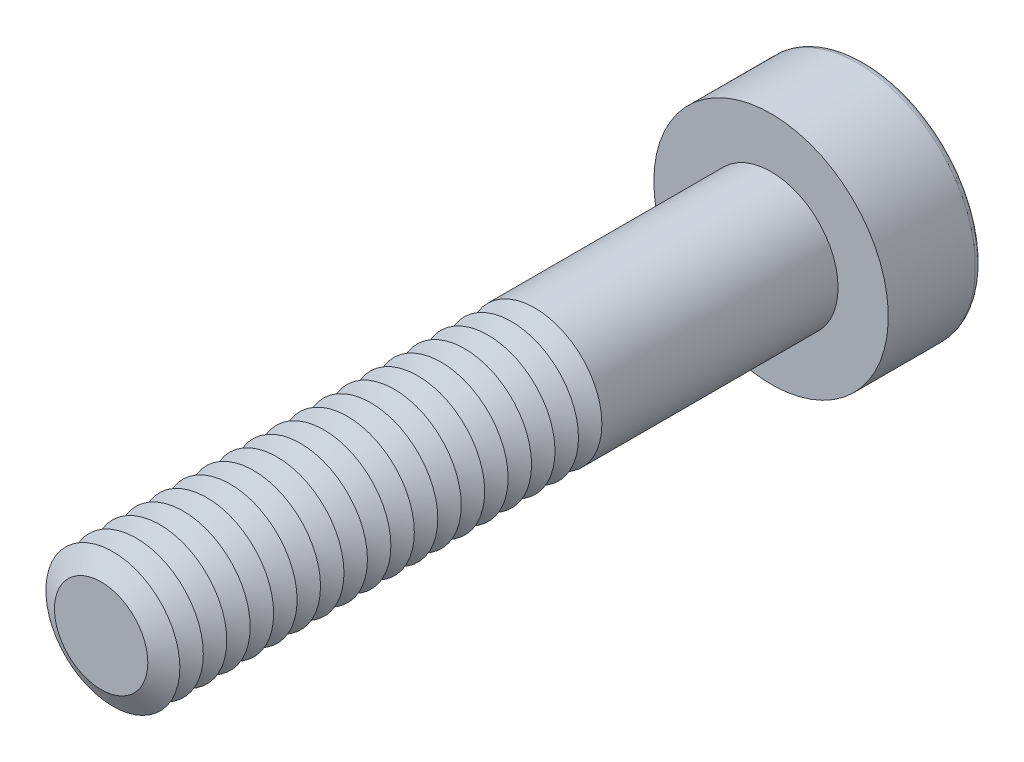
ISO-10303-21;
HEADER;
FILE_DESCRIPTION(('STEP AP214'),'2;1');
FILE_NAME('part.step','',(''),(''),'','','');
FILE_SCHEMA(('AUTOMOTIVE_DESIGN { 1 0 10303 214 1 1 1 1 }'));
ENDSEC;
DATA;
#1=APPLICATION_CONTEXT('core data for automotive mechanical design processes');
#2=APPLICATION_PROTOCOL_DEFINITION('international standard','automotive_design',2000,#1);
#3=PRODUCT_CONTEXT('',#1,'mechanical');
#4=PRODUCT('Part','Part','',(#3));
#5=PRODUCT_RELATED_PRODUCT_CATEGORY('part','',(#4));
#6=PRODUCT_DEFINITION_FORMATION('','',#4);
#7=PRODUCT_DEFINITION_CONTEXT('part definition',#1,'design');
#8=PRODUCT_DEFINITION('design','',#6,#7);
#9=PRODUCT_DEFINITION_SHAPE('','',#8);
#10=(LENGTH_UNIT() NAMED_UNIT(*) SI_UNIT(.MILLI.,.METRE.));
#11=(NAMED_UNIT(*) PLANE_ANGLE_UNIT() SI_UNIT($,.RADIAN.));
#12=(NAMED_UNIT(*) SI_UNIT($,.STERADIAN.) SOLID_ANGLE_UNIT());
#13=UNCERTAINTY_MEASURE_WITH_UNIT(LENGTH_MEASURE(1.E-05),#10,'distance_accuracy_value','');
#14=(GEOMETRIC_REPRESENTATION_CONTEXT(3) GLOBAL_UNCERTAINTY_ASSIGNED_CONTEXT((#13)) GLOBAL_UNIT_ASSIGNED_CONTEXT((#10,
#11,#12)) REPRESENTATION_CONTEXT('',''));
#15=CARTESIAN_POINT('',(0.,0.,0.));
#16=DIRECTION('',(0.,0.,1.));
#17=DIRECTION('',(1.,0.,0.));
#18=AXIS2_PLACEMENT_3D('',#15,#16,#17);
#19=CARTESIAN_POINT('',(0.,0.,17.55));
#20=DIRECTION('',(0.,0.,1.));
#21=DIRECTION('',(1.,0.,0.));
#22=AXIS2_PLACEMENT_3D('',#19,#20,#21);
#23=CONICAL_SURFACE('',#22,2.,1.0471975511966);
#24=CARTESIAN_POINT('',(0.,0.,17.2));
#25=DIRECTION('',(0.,0.,1.));
#26=DIRECTION('',(1.,0.,0.));
#27=AXIS2_PLACEMENT_3D('',#24,#25,#26);
#28=CIRCLE('',#27,1.39378221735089);
#29=CARTESIAN_POINT('',(1.39378221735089,0.,17.2));
#30=VERTEX_POINT('',#29);
#31=EDGE_CURVE('E312',#30,#30,#28,.T.);
#32=ORIENTED_EDGE('',*,*,#31,.T.);
#33=EDGE_LOOP('',(#32));
#34=FACE_BOUND('',#33,.T.);
#35=CARTESIAN_POINT('',(0.,0.,17.55));
#36=DIRECTION('',(0.,0.,1.));
#37=DIRECTION('',(1.,0.,0.));
#38=AXIS2_PLACEMENT_3D('',#35,#36,#37);
#39=CIRCLE('',#38,2.);
#40=CARTESIAN_POINT('',(2.,0.,17.55));
#41=VERTEX_POINT('',#40);
#42=EDGE_CURVE('E315',#41,#41,#39,.T.);
#43=ORIENTED_EDGE('',*,*,#42,.F.);
#44=EDGE_LOOP('',(#43));
#45=FACE_BOUND('',#44,.T.);
#46=ADVANCED_FACE('F39',(#34,#45),#23,.T.);
#47=CARTESIAN_POINT('',(0.,0.,17.2));
#48=DIRECTION('',(0.,0.,-1.));
#49=DIRECTION('',(-1.,0.,0.));
#50=AXIS2_PLACEMENT_3D('',#47,#48,#49);
#51=CONICAL_SURFACE('',#50,1.39378221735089,1.0471975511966);
#52=CARTESIAN_POINT('',(0.,0.,16.85));
#53=DIRECTION('',(0.,0.,1.));
#54=DIRECTION('',(1.,0.,0.));
#55=AXIS2_PLACEMENT_3D('',#52,#53,#54);
#56=CIRCLE('',#55,2.);
#57=CARTESIAN_POINT('',(2.,0.,16.85));
#58=VERTEX_POINT('',#57);
#59=EDGE_CURVE('E323',#58,#58,#56,.T.);
#60=ORIENTED_EDGE('',*,*,#59,.T.);
#61=EDGE_LOOP('',(#60));
#62=FACE_BOUND('',#61,.T.);
#63=ORIENTED_EDGE('',*,*,#31,.F.);
#64=EDGE_LOOP('',(#63));
#65=FACE_BOUND('',#64,.T.);
#66=ADVANCED_FACE('F245',(#62,#65),#51,.T.);
#67=CARTESIAN_POINT('',(0.,0.,20.));
#68=DIRECTION('',(0.,0.,1.));
#69=DIRECTION('',(1.,0.,0.));
#70=AXIS2_PLACEMENT_3D('',#67,#68,#69);
#71=PLANE('',#70);
#72=CARTESIAN_POINT('',(0.,0.,20.));
#73=DIRECTION('',(0.,0.,1.));
#74=DIRECTION('',(1.,0.,0.));
#75=AXIS2_PLACEMENT_3D('',#72,#73,#74);
#76=CIRCLE('',#75,1.39378221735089);
#77=CARTESIAN_POINT('',(1.39378221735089,0.,20.));
#78=VERTEX_POINT('',#77);
#79=EDGE_CURVE('E174',#78,#78,#76,.T.);
#80=ORIENTED_EDGE('',*,*,#79,.T.);
#81=EDGE_LOOP('',(#80));
#82=FACE_BOUND('',#81,.T.);
#83=ADVANCED_FACE('F251',(#82),#71,.T.);
#84=CARTESIAN_POINT('',(0.,0.,20.));
#85=DIRECTION('',(0.,0.,-1.));
#86=DIRECTION('',(-1.,0.,0.));
#87=AXIS2_PLACEMENT_3D('',#84,#85,#86);
#88=CONICAL_SURFACE('',#87,1.39378221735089,1.0471975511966);
#89=CARTESIAN_POINT('',(0.,0.,19.65));
#90=DIRECTION('',(0.,0.,1.));
#91=DIRECTION('',(1.,0.,0.));
#92=AXIS2_PLACEMENT_3D('',#89,#90,#91);
#93=CIRCLE('',#92,2.);
#94=CARTESIAN_POINT('',(2.,0.,19.65));
#95=VERTEX_POINT('',#94);
#96=EDGE_CURVE('E291',#95,#95,#93,.T.);
#97=ORIENTED_EDGE('',*,*,#96,.T.);
#98=EDGE_LOOP('',(#97));
#99=FACE_BOUND('',#98,.T.);
#100=ORIENTED_EDGE('',*,*,#79,.F.);
#101=EDGE_LOOP('',(#100));
#102=FACE_BOUND('',#101,.T.);
#103=ADVANCED_FACE('F199',(#99,#102),#88,.T.);
#104=CARTESIAN_POINT('',(0.,0.,19.65));
#105=DIRECTION('',(0.,0.,1.));
#106=DIRECTION('',(1.,0.,0.));
#107=AXIS2_PLACEMENT_3D('',#104,#105,#106);
#108=CONICAL_SURFACE('',#107,2.,1.0471975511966);
#109=CARTESIAN_POINT('',(0.,0.,19.3));
#110=DIRECTION('',(0.,0.,1.));
#111=DIRECTION('',(1.,0.,0.));
#112=AXIS2_PLACEMENT_3D('',#109,#110,#111);
#113=CIRCLE('',#112,1.39378221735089);
#114=CARTESIAN_POINT('',(1.39378221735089,0.,19.3));
#115=VERTEX_POINT('',#114);
#116=EDGE_CURVE('E288',#115,#115,#113,.T.);
#117=ORIENTED_EDGE('',*,*,#116,.T.);
#118=EDGE_LOOP('',(#117));
#119=FACE_BOUND('',#118,.T.);
#120=ORIENTED_EDGE('',*,*,#96,.F.);
#121=EDGE_LOOP('',(#120));
#122=FACE_BOUND('',#121,.T.);
#123=ADVANCED_FACE('F277',(#119,#122),#108,.T.);
#124=CARTESIAN_POINT('',(0.,0.,19.3));
#125=DIRECTION('',(0.,0.,-1.));
#126=DIRECTION('',(-1.,0.,0.));
#127=AXIS2_PLACEMENT_3D('',#124,#125,#126);
#128=CONICAL_SURFACE('',#127,1.39378221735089,1.0471975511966);
#129=CARTESIAN_POINT('',(0.,0.,18.95));
#130=DIRECTION('',(0.,0.,1.));
#131=DIRECTION('',(1.,0.,0.));
#132=AXIS2_PLACEMENT_3D('',#129,#130,#131);
#133=CIRCLE('',#132,2.);
#134=CARTESIAN_POINT('',(2.,0.,18.95));
#135=VERTEX_POINT('',#134);
#136=EDGE_CURVE('E299',#135,#135,#133,.T.);
#137=ORIENTED_EDGE('',*,*,#136,.T.);
#138=EDGE_LOOP('',(#137));
#139=FACE_BOUND('',#138,.T.);
#140=ORIENTED_EDGE('',*,*,#116,.F.);
#141=EDGE_LOOP('',(#140));
#142=FACE_BOUND('',#141,.T.);
#143=ADVANCED_FACE('F274',(#139,#142),#128,.T.);
#144=CARTESIAN_POINT('',(0.,0.,18.95));
#145=DIRECTION('',(0.,0.,1.));
#146=DIRECTION('',(1.,0.,0.));
#147=AXIS2_PLACEMENT_3D('',#144,#145,#146);
#148=CONICAL_SURFACE('',#147,2.,1.0471975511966);
#149=CARTESIAN_POINT('',(0.,0.,18.6));
#150=DIRECTION('',(0.,0.,1.));
#151=DIRECTION('',(1.,0.,0.));
#152=AXIS2_PLACEMENT_3D('',#149,#150,#151);
#153=CIRCLE('',#152,1.39378221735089);
#154=CARTESIAN_POINT('',(1.39378221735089,0.,18.6));
#155=VERTEX_POINT('',#154);
#156=EDGE_CURVE('E293',#155,#155,#153,.T.);
#157=ORIENTED_EDGE('',*,*,#156,.T.);
#158=EDGE_LOOP('',(#157));
#159=FACE_BOUND('',#158,.T.);
#160=ORIENTED_EDGE('',*,*,#136,.F.);
#161=EDGE_LOOP('',(#160));
#162=FACE_BOUND('',#161,.T.);
#163=ADVANCED_FACE('F270',(#159,#162),#148,.T.);
#164=CARTESIAN_POINT('',(0.,0.,18.6));
#165=DIRECTION('',(0.,0.,-1.));
#166=DIRECTION('',(-1.,0.,0.));
#167=AXIS2_PLACEMENT_3D('',#164,#165,#166);
#168=CONICAL_SURFACE('',#167,1.39378221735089,1.0471975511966);
#169=CARTESIAN_POINT('',(0.,0.,18.25));
#170=DIRECTION('',(0.,0.,1.));
#171=DIRECTION('',(1.,0.,0.));
#172=AXIS2_PLACEMENT_3D('',#169,#170,#171);
#173=CIRCLE('',#172,2.);
#174=CARTESIAN_POINT('',(2.,0.,18.25));
#175=VERTEX_POINT('',#174);
#176=EDGE_CURVE('E309',#175,#175,#173,.T.);
#177=ORIENTED_EDGE('',*,*,#176,.T.);
#178=EDGE_LOOP('',(#177));
#179=FACE_BOUND('',#178,.T.);
#180=ORIENTED_EDGE('',*,*,#156,.F.);
#181=EDGE_LOOP('',(#180));
#182=FACE_BOUND('',#181,.T.);
#183=ADVANCED_FACE('F266',(#179,#182),#168,.T.);
#184=CARTESIAN_POINT('',(0.,0.,18.25));
#185=DIRECTION('',(0.,0.,1.));
#186=DIRECTION('',(1.,0.,0.));
#187=AXIS2_PLACEMENT_3D('',#184,#185,#186);
#188=CONICAL_SURFACE('',#187,2.,1.0471975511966);
#189=CARTESIAN_POINT('',(0.,0.,17.9));
#190=DIRECTION('',(0.,0.,1.));
#191=DIRECTION('',(1.,0.,0.));
#192=AXIS2_PLACEMENT_3D('',#189,#190,#191);
#193=CIRCLE('',#192,1.39378221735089);
#194=CARTESIAN_POINT('',(1.39378221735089,0.,17.9));
#195=VERTEX_POINT('',#194);
#196=EDGE_CURVE('E305',#195,#195,#193,.T.);
#197=ORIENTED_EDGE('',*,*,#196,.T.);
#198=EDGE_LOOP('',(#197));
#199=FACE_BOUND('',#198,.T.);
#200=ORIENTED_EDGE('',*,*,#176,.F.);
#201=EDGE_LOOP('',(#200));
#202=FACE_BOUND('',#201,.T.);
#203=ADVANCED_FACE('F262',(#199,#202),#188,.T.);
#204=CARTESIAN_POINT('',(0.,0.,17.9));
#205=DIRECTION('',(0.,0.,-1.));
#206=DIRECTION('',(-1.,0.,0.));
#207=AXIS2_PLACEMENT_3D('',#204,#205,#206);
#208=CONICAL_SURFACE('',#207,1.39378221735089,1.0471975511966);
#209=ORIENTED_EDGE('',*,*,#42,.T.);
#210=EDGE_LOOP('',(#209));
#211=FACE_BOUND('',#210,.T.);
#212=ORIENTED_EDGE('',*,*,#196,.F.);
#213=EDGE_LOOP('',(#212));
#214=FACE_BOUND('',#213,.T.);
#215=ADVANCED_FACE('F258',(#211,#214),#208,.T.);
#216=CARTESIAN_POINT('',(0.,0.,16.85));
#217=DIRECTION('',(0.,0.,1.));
#218=DIRECTION('',(1.,0.,0.));
#219=AXIS2_PLACEMENT_3D('',#216,#217,#218);
#220=CONICAL_SURFACE('',#219,2.,1.0471975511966);
#221=CARTESIAN_POINT('',(0.,0.,16.5));
#222=DIRECTION('',(0.,0.,1.));
#223=DIRECTION('',(1.,0.,0.));
#224=AXIS2_PLACEMENT_3D('',#221,#222,#223);
#225=CIRCLE('',#224,1.39378221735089);
#226=CARTESIAN_POINT('',(1.39378221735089,0.,16.5));
#227=VERTEX_POINT('',#226);
#228=EDGE_CURVE('E319',#227,#227,#225,.T.);
#229=ORIENTED_EDGE('',*,*,#228,.T.);
#230=EDGE_LOOP('',(#229));
#231=FACE_BOUND('',#230,.T.);
#232=ORIENTED_EDGE('',*,*,#59,.F.);
#233=EDGE_LOOP('',(#232));
#234=FACE_BOUND('',#233,.T.);
#235=ADVANCED_FACE('F261',(#231,#234),#220,.T.);
#236=CARTESIAN_POINT('',(0.,0.,16.5));
#237=DIRECTION('',(0.,0.,-1.));
#238=DIRECTION('',(-1.,0.,0.));
#239=AXIS2_PLACEMENT_3D('',#236,#237,#238);
#240=CONICAL_SURFACE('',#239,1.39378221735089,1.0471975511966);
#241=CARTESIAN_POINT('',(0.,0.,16.15));
#242=DIRECTION('',(0.,0.,1.));
#243=DIRECTION('',(1.,0.,0.));
#244=AXIS2_PLACEMENT_3D('',#241,#242,#243);
#245=CIRCLE('',#244,2.);
#246=CARTESIAN_POINT('',(2.,0.,16.15));
#247=VERTEX_POINT('',#246);
#248=EDGE_CURVE('E331',#247,#247,#245,.T.);
#249=ORIENTED_EDGE('',*,*,#248,.T.);
#250=EDGE_LOOP('',(#249));
#251=FACE_BOUND('',#250,.T.);
#252=ORIENTED_EDGE('',*,*,#228,.F.);
#253=EDGE_LOOP('',(#252));
#254=FACE_BOUND('',#253,.T.);
#255=ADVANCED_FACE('F543',(#251,#254),#240,.T.);
#256=CARTESIAN_POINT('',(0.,0.,16.15));
#257=DIRECTION('',(0.,0.,1.));
#258=DIRECTION('',(1.,0.,0.));
#259=AXIS2_PLACEMENT_3D('',#256,#257,#258);
#260=CONICAL_SURFACE('',#259,2.,1.0471975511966);
#261=CARTESIAN_POINT('',(0.,0.,15.8));
#262=DIRECTION('',(0.,0.,1.));
#263=DIRECTION('',(1.,0.,0.));
#264=AXIS2_PLACEMENT_3D('',#261,#262,#263);
#265=CIRCLE('',#264,1.39378221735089);
#266=CARTESIAN_POINT('',(1.39378221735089,0.,15.8));
#267=VERTEX_POINT('',#266);
#268=EDGE_CURVE('E327',#267,#267,#265,.T.);
#269=ORIENTED_EDGE('',*,*,#268,.T.);
#270=EDGE_LOOP('',(#269));
#271=FACE_BOUND('',#270,.T.);
#272=ORIENTED_EDGE('',*,*,#248,.F.);
#273=EDGE_LOOP('',(#272));
#274=FACE_BOUND('',#273,.T.);
#275=ADVANCED_FACE('F539',(#271,#274),#260,.T.);
#276=CARTESIAN_POINT('',(0.,0.,15.8));
#277=DIRECTION('',(0.,0.,-1.));
#278=DIRECTION('',(-1.,0.,0.));
#279=AXIS2_PLACEMENT_3D('',#276,#277,#278);
#280=CONICAL_SURFACE('',#279,1.39378221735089,1.0471975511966);
#281=CARTESIAN_POINT('',(0.,0.,15.45));
#282=DIRECTION('',(0.,0.,1.));
#283=DIRECTION('',(1.,0.,0.));
#284=AXIS2_PLACEMENT_3D('',#281,#282,#283);
#285=CIRCLE('',#284,2.);
#286=CARTESIAN_POINT('',(2.,0.,15.45));
#287=VERTEX_POINT('',#286);
#288=EDGE_CURVE('E339',#287,#287,#285,.T.);
#289=ORIENTED_EDGE('',*,*,#288,.T.);
#290=EDGE_LOOP('',(#289));
#291=FACE_BOUND('',#290,.T.);
#292=ORIENTED_EDGE('',*,*,#268,.F.);
#293=EDGE_LOOP('',(#292));
#294=FACE_BOUND('',#293,.T.);
#295=ADVANCED_FACE('F535',(#291,#294),#280,.T.);
#296=CARTESIAN_POINT('',(0.,0.,15.45));
#297=DIRECTION('',(0.,0.,1.));
#298=DIRECTION('',(1.,0.,0.));
#299=AXIS2_PLACEMENT_3D('',#296,#297,#298);
#300=CONICAL_SURFACE('',#299,2.,1.0471975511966);
#301=CARTESIAN_POINT('',(0.,0.,15.1));
#302=DIRECTION('',(0.,0.,1.));
#303=DIRECTION('',(1.,0.,0.));
#304=AXIS2_PLACEMENT_3D('',#301,#302,#303);
#305=CIRCLE('',#304,1.39378221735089);
#306=CARTESIAN_POINT('',(1.39378221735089,0.,15.1));
#307=VERTEX_POINT('',#306);
#308=EDGE_CURVE('E335',#307,#307,#305,.T.);
#309=ORIENTED_EDGE('',*,*,#308,.T.);
#310=EDGE_LOOP('',(#309));
#311=FACE_BOUND('',#310,.T.);
#312=ORIENTED_EDGE('',*,*,#288,.F.);
#313=EDGE_LOOP('',(#312));
#314=FACE_BOUND('',#313,.T.);
#315=ADVANCED_FACE('F531',(#311,#314),#300,.T.);
#316=CARTESIAN_POINT('',(0.,0.,15.1));
#317=DIRECTION('',(0.,0.,-1.));
#318=DIRECTION('',(-1.,0.,0.));
#319=AXIS2_PLACEMENT_3D('',#316,#317,#318);
#320=CONICAL_SURFACE('',#319,1.39378221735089,1.0471975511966);
#321=CARTESIAN_POINT('',(0.,0.,14.75));
#322=DIRECTION('',(0.,0.,1.));
#323=DIRECTION('',(1.,0.,0.));
#324=AXIS2_PLACEMENT_3D('',#321,#322,#323);
#325=CIRCLE('',#324,2.);
#326=CARTESIAN_POINT('',(2.,0.,14.75));
#327=VERTEX_POINT('',#326);
#328=EDGE_CURVE('E347',#327,#327,#325,.T.);
#329=ORIENTED_EDGE('',*,*,#328,.T.);
#330=EDGE_LOOP('',(#329));
#331=FACE_BOUND('',#330,.T.);
#332=ORIENTED_EDGE('',*,*,#308,.F.);
#333=EDGE_LOOP('',(#332));
#334=FACE_BOUND('',#333,.T.);
#335=ADVANCED_FACE('F527',(#331,#334),#320,.T.);
#336=CARTESIAN_POINT('',(0.,0.,14.75));
#337=DIRECTION('',(0.,0.,1.));
#338=DIRECTION('',(1.,0.,0.));
#339=AXIS2_PLACEMENT_3D('',#336,#337,#338);
#340=CONICAL_SURFACE('',#339,2.,1.0471975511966);
#341=CARTESIAN_POINT('',(0.,0.,14.4));
#342=DIRECTION('',(0.,0.,1.));
#343=DIRECTION('',(1.,0.,0.));
#344=AXIS2_PLACEMENT_3D('',#341,#342,#343);
#345=CIRCLE('',#344,1.39378221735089);
#346=CARTESIAN_POINT('',(1.39378221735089,0.,14.4));
#347=VERTEX_POINT('',#346);
#348=EDGE_CURVE('E343',#347,#347,#345,.T.);
#349=ORIENTED_EDGE('',*,*,#348,.T.);
#350=EDGE_LOOP('',(#349));
#351=FACE_BOUND('',#350,.T.);
#352=ORIENTED_EDGE('',*,*,#328,.F.);
#353=EDGE_LOOP('',(#352));
#354=FACE_BOUND('',#353,.T.);
#355=ADVANCED_FACE('F523',(#351,#354),#340,.T.);
#356=CARTESIAN_POINT('',(0.,0.,14.4));
#357=DIRECTION('',(0.,0.,-1.));
#358=DIRECTION('',(-1.,0.,0.));
#359=AXIS2_PLACEMENT_3D('',#356,#357,#358);
#360=CONICAL_SURFACE('',#359,1.39378221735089,1.0471975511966);
#361=CARTESIAN_POINT('',(0.,0.,14.05));
#362=DIRECTION('',(0.,0.,1.));
#363=DIRECTION('',(1.,0.,0.));
#364=AXIS2_PLACEMENT_3D('',#361,#362,#363);
#365=CIRCLE('',#364,2.);
#366=CARTESIAN_POINT('',(2.,0.,14.05));
#367=VERTEX_POINT('',#366);
#368=EDGE_CURVE('E355',#367,#367,#365,.T.);
#369=ORIENTED_EDGE('',*,*,#368,.T.);
#370=EDGE_LOOP('',(#369));
#371=FACE_BOUND('',#370,.T.);
#372=ORIENTED_EDGE('',*,*,#348,.F.);
#373=EDGE_LOOP('',(#372));
#374=FACE_BOUND('',#373,.T.);
#375=ADVANCED_FACE('F519',(#371,#374),#360,.T.);
#376=CARTESIAN_POINT('',(0.,0.,14.05));
#377=DIRECTION('',(0.,0.,1.));
#378=DIRECTION('',(1.,0.,0.));
#379=AXIS2_PLACEMENT_3D('',#376,#377,#378);
#380=CONICAL_SURFACE('',#379,2.,1.0471975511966);
#381=CARTESIAN_POINT('',(0.,0.,13.7));
#382=DIRECTION('',(0.,0.,1.));
#383=DIRECTION('',(1.,0.,0.));
#384=AXIS2_PLACEMENT_3D('',#381,#382,#383);
#385=CIRCLE('',#384,1.39378221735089);
#386=CARTESIAN_POINT('',(1.39378221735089,0.,13.7));
#387=VERTEX_POINT('',#386);
#388=EDGE_CURVE('E351',#387,#387,#385,.T.);
#389=ORIENTED_EDGE('',*,*,#388,.T.);
#390=EDGE_LOOP('',(#389));
#391=FACE_BOUND('',#390,.T.);
#392=ORIENTED_EDGE('',*,*,#368,.F.);
#393=EDGE_LOOP('',(#392));
#394=FACE_BOUND('',#393,.T.);
#395=ADVANCED_FACE('F515',(#391,#394),#380,.T.);
#396=CARTESIAN_POINT('',(0.,0.,13.7));
#397=DIRECTION('',(0.,0.,-1.));
#398=DIRECTION('',(-1.,0.,0.));
#399=AXIS2_PLACEMENT_3D('',#396,#397,#398);
#400=CONICAL_SURFACE('',#399,1.39378221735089,1.0471975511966);
#401=CARTESIAN_POINT('',(0.,0.,13.35));
#402=DIRECTION('',(0.,0.,1.));
#403=DIRECTION('',(1.,0.,0.));
#404=AXIS2_PLACEMENT_3D('',#401,#402,#403);
#405=CIRCLE('',#404,2.);
#406=CARTESIAN_POINT('',(2.,0.,13.35));
#407=VERTEX_POINT('',#406);
#408=EDGE_CURVE('E363',#407,#407,#405,.T.);
#409=ORIENTED_EDGE('',*,*,#408,.T.);
#410=EDGE_LOOP('',(#409));
#411=FACE_BOUND('',#410,.T.);
#412=ORIENTED_EDGE('',*,*,#388,.F.);
#413=EDGE_LOOP('',(#412));
#414=FACE_BOUND('',#413,.T.);
#415=ADVANCED_FACE('F511',(#411,#414),#400,.T.);
#416=CARTESIAN_POINT('',(0.,0.,13.35));
#417=DIRECTION('',(0.,0.,1.));
#418=DIRECTION('',(1.,0.,0.));
#419=AXIS2_PLACEMENT_3D('',#416,#417,#418);
#420=CONICAL_SURFACE('',#419,2.,1.0471975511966);
#421=CARTESIAN_POINT('',(0.,0.,13.));
#422=DIRECTION('',(0.,0.,1.));
#423=DIRECTION('',(1.,0.,0.));
#424=AXIS2_PLACEMENT_3D('',#421,#422,#423);
#425=CIRCLE('',#424,1.39378221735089);
#426=CARTESIAN_POINT('',(1.39378221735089,0.,13.));
#427=VERTEX_POINT('',#426);
#428=EDGE_CURVE('E359',#427,#427,#425,.T.);
#429=ORIENTED_EDGE('',*,*,#428,.T.);
#430=EDGE_LOOP('',(#429));
#431=FACE_BOUND('',#430,.T.);
#432=ORIENTED_EDGE('',*,*,#408,.F.);
#433=EDGE_LOOP('',(#432));
#434=FACE_BOUND('',#433,.T.);
#435=ADVANCED_FACE('F507',(#431,#434),#420,.T.);
#436=CARTESIAN_POINT('',(0.,0.,13.));
#437=DIRECTION('',(0.,0.,-1.));
#438=DIRECTION('',(-1.,0.,0.));
#439=AXIS2_PLACEMENT_3D('',#436,#437,#438);
#440=CONICAL_SURFACE('',#439,1.39378221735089,1.0471975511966);
#441=CARTESIAN_POINT('',(0.,0.,12.65));
#442=DIRECTION('',(0.,0.,1.));
#443=DIRECTION('',(1.,0.,0.));
#444=AXIS2_PLACEMENT_3D('',#441,#442,#443);
#445=CIRCLE('',#444,2.);
#446=CARTESIAN_POINT('',(2.,0.,12.65));
#447=VERTEX_POINT('',#446);
#448=EDGE_CURVE('E371',#447,#447,#445,.T.);
#449=ORIENTED_EDGE('',*,*,#448,.T.);
#450=EDGE_LOOP('',(#449));
#451=FACE_BOUND('',#450,.T.);
#452=ORIENTED_EDGE('',*,*,#428,.F.);
#453=EDGE_LOOP('',(#452));
#454=FACE_BOUND('',#453,.T.);
#455=ADVANCED_FACE('F503',(#451,#454),#440,.T.);
#456=CARTESIAN_POINT('',(0.,0.,12.65));
#457=DIRECTION('',(0.,0.,1.));
#458=DIRECTION('',(1.,0.,0.));
#459=AXIS2_PLACEMENT_3D('',#456,#457,#458);
#460=CONICAL_SURFACE('',#459,2.,1.0471975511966);
#461=CARTESIAN_POINT('',(0.,0.,12.3));
#462=DIRECTION('',(0.,0.,1.));
#463=DIRECTION('',(1.,0.,0.));
#464=AXIS2_PLACEMENT_3D('',#461,#462,#463);
#465=CIRCLE('',#464,1.39378221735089);
#466=CARTESIAN_POINT('',(1.39378221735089,0.,12.3));
#467=VERTEX_POINT('',#466);
#468=EDGE_CURVE('E367',#467,#467,#465,.T.);
#469=ORIENTED_EDGE('',*,*,#468,.T.);
#470=EDGE_LOOP('',(#469));
#471=FACE_BOUND('',#470,.T.);
#472=ORIENTED_EDGE('',*,*,#448,.F.);
#473=EDGE_LOOP('',(#472));
#474=FACE_BOUND('',#473,.T.);
#475=ADVANCED_FACE('F499',(#471,#474),#460,.T.);
#476=CARTESIAN_POINT('',(0.,0.,12.3));
#477=DIRECTION('',(0.,0.,-1.));
#478=DIRECTION('',(-1.,0.,0.));
#479=AXIS2_PLACEMENT_3D('',#476,#477,#478);
#480=CONICAL_SURFACE('',#479,1.39378221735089,1.0471975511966);
#481=CARTESIAN_POINT('',(0.,0.,11.95));
#482=DIRECTION('',(0.,0.,1.));
#483=DIRECTION('',(1.,0.,0.));
#484=AXIS2_PLACEMENT_3D('',#481,#482,#483);
#485=CIRCLE('',#484,2.);
#486=CARTESIAN_POINT('',(2.,0.,11.95));
#487=VERTEX_POINT('',#486);
#488=EDGE_CURVE('E379',#487,#487,#485,.T.);
#489=ORIENTED_EDGE('',*,*,#488,.T.);
#490=EDGE_LOOP('',(#489));
#491=FACE_BOUND('',#490,.T.);
#492=ORIENTED_EDGE('',*,*,#468,.F.);
#493=EDGE_LOOP('',(#492));
#494=FACE_BOUND('',#493,.T.);
#495=ADVANCED_FACE('F495',(#491,#494),#480,.T.);
#496=CARTESIAN_POINT('',(0.,0.,11.95));
#497=DIRECTION('',(0.,0.,1.));
#498=DIRECTION('',(1.,0.,0.));
#499=AXIS2_PLACEMENT_3D('',#496,#497,#498);
#500=CONICAL_SURFACE('',#499,2.,1.0471975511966);
#501=CARTESIAN_POINT('',(0.,0.,11.6));
#502=DIRECTION('',(0.,0.,1.));
#503=DIRECTION('',(1.,0.,0.));
#504=AXIS2_PLACEMENT_3D('',#501,#502,#503);
#505=CIRCLE('',#504,1.39378221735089);
#506=CARTESIAN_POINT('',(1.39378221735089,0.,11.6));
#507=VERTEX_POINT('',#506);
#508=EDGE_CURVE('E375',#507,#507,#505,.T.);
#509=ORIENTED_EDGE('',*,*,#508,.T.);
#510=EDGE_LOOP('',(#509));
#511=FACE_BOUND('',#510,.T.);
#512=ORIENTED_EDGE('',*,*,#488,.F.);
#513=EDGE_LOOP('',(#512));
#514=FACE_BOUND('',#513,.T.);
#515=ADVANCED_FACE('F491',(#511,#514),#500,.T.);
#516=CARTESIAN_POINT('',(0.,0.,11.6));
#517=DIRECTION('',(0.,0.,-1.));
#518=DIRECTION('',(-1.,0.,0.));
#519=AXIS2_PLACEMENT_3D('',#516,#517,#518);
#520=CONICAL_SURFACE('',#519,1.39378221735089,1.0471975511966);
#521=CARTESIAN_POINT('',(0.,0.,11.25));
#522=DIRECTION('',(0.,0.,1.));
#523=DIRECTION('',(1.,0.,0.));
#524=AXIS2_PLACEMENT_3D('',#521,#522,#523);
#525=CIRCLE('',#524,2.);
#526=CARTESIAN_POINT('',(2.,0.,11.25));
#527=VERTEX_POINT('',#526);
#528=EDGE_CURVE('E387',#527,#527,#525,.T.);
#529=ORIENTED_EDGE('',*,*,#528,.T.);
#530=EDGE_LOOP('',(#529));
#531=FACE_BOUND('',#530,.T.);
#532=ORIENTED_EDGE('',*,*,#508,.F.);
#533=EDGE_LOOP('',(#532));
#534=FACE_BOUND('',#533,.T.);
#535=ADVANCED_FACE('F487',(#531,#534),#520,.T.);
#536=CARTESIAN_POINT('',(0.,0.,11.25));
#537=DIRECTION('',(0.,0.,1.));
#538=DIRECTION('',(1.,0.,0.));
#539=AXIS2_PLACEMENT_3D('',#536,#537,#538);
#540=CONICAL_SURFACE('',#539,2.,1.0471975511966);
#541=CARTESIAN_POINT('',(0.,0.,10.9));
#542=DIRECTION('',(0.,0.,1.));
#543=DIRECTION('',(1.,0.,0.));
#544=AXIS2_PLACEMENT_3D('',#541,#542,#543);
#545=CIRCLE('',#544,1.39378221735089);
#546=CARTESIAN_POINT('',(1.39378221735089,0.,10.9));
#547=VERTEX_POINT('',#546);
#548=EDGE_CURVE('E383',#547,#547,#545,.T.);
#549=ORIENTED_EDGE('',*,*,#548,.T.);
#550=EDGE_LOOP('',(#549));
#551=FACE_BOUND('',#550,.T.);
#552=ORIENTED_EDGE('',*,*,#528,.F.);
#553=EDGE_LOOP('',(#552));
#554=FACE_BOUND('',#553,.T.);
#555=ADVANCED_FACE('F483',(#551,#554),#540,.T.);
#556=CARTESIAN_POINT('',(0.,0.,10.9));
#557=DIRECTION('',(0.,0.,-1.));
#558=DIRECTION('',(-1.,0.,0.));
#559=AXIS2_PLACEMENT_3D('',#556,#557,#558);
#560=CONICAL_SURFACE('',#559,1.39378221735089,1.0471975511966);
#561=CARTESIAN_POINT('',(0.,0.,10.55));
#562=DIRECTION('',(0.,0.,1.));
#563=DIRECTION('',(1.,0.,0.));
#564=AXIS2_PLACEMENT_3D('',#561,#562,#563);
#565=CIRCLE('',#564,2.);
#566=CARTESIAN_POINT('',(2.,0.,10.55));
#567=VERTEX_POINT('',#566);
#568=EDGE_CURVE('E394',#567,#567,#565,.T.);
#569=ORIENTED_EDGE('',*,*,#568,.T.);
#570=EDGE_LOOP('',(#569));
#571=FACE_BOUND('',#570,.T.);
#572=ORIENTED_EDGE('',*,*,#548,.F.);
#573=EDGE_LOOP('',(#572));
#574=FACE_BOUND('',#573,.T.);
#575=ADVANCED_FACE('F479',(#571,#574),#560,.T.);
#576=CARTESIAN_POINT('',(0.,0.,10.55));
#577=DIRECTION('',(0.,0.,1.));
#578=DIRECTION('',(1.,0.,0.));
#579=AXIS2_PLACEMENT_3D('',#576,#577,#578);
#580=CONICAL_SURFACE('',#579,2.,1.0471975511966);
#581=CARTESIAN_POINT('',(0.,0.,10.2));
#582=DIRECTION('',(0.,0.,1.));
#583=DIRECTION('',(1.,0.,0.));
#584=AXIS2_PLACEMENT_3D('',#581,#582,#583);
#585=CIRCLE('',#584,1.39378221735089);
#586=CARTESIAN_POINT('',(1.39378221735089,0.,10.2));
#587=VERTEX_POINT('',#586);
#588=EDGE_CURVE('E390',#587,#587,#585,.T.);
#589=ORIENTED_EDGE('',*,*,#588,.T.);
#590=EDGE_LOOP('',(#589));
#591=FACE_BOUND('',#590,.T.);
#592=ORIENTED_EDGE('',*,*,#568,.F.);
#593=EDGE_LOOP('',(#592));
#594=FACE_BOUND('',#593,.T.);
#595=ADVANCED_FACE('F475',(#591,#594),#580,.T.);
#596=CARTESIAN_POINT('',(0.,0.,10.2));
#597=DIRECTION('',(0.,0.,-1.));
#598=DIRECTION('',(-1.,0.,0.));
#599=AXIS2_PLACEMENT_3D('',#596,#597,#598);
#600=CONICAL_SURFACE('',#599,1.39378221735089,1.0471975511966);
#601=CARTESIAN_POINT('',(0.,0.,9.85));
#602=DIRECTION('',(0.,0.,1.));
#603=DIRECTION('',(1.,0.,0.));
#604=AXIS2_PLACEMENT_3D('',#601,#602,#603);
#605=CIRCLE('',#604,2.);
#606=CARTESIAN_POINT('',(2.,0.,9.85));
#607=VERTEX_POINT('',#606);
#608=EDGE_CURVE('E402',#607,#607,#605,.T.);
#609=ORIENTED_EDGE('',*,*,#608,.T.);
#610=EDGE_LOOP('',(#609));
#611=FACE_BOUND('',#610,.T.);
#612=ORIENTED_EDGE('',*,*,#588,.F.);
#613=EDGE_LOOP('',(#612));
#614=FACE_BOUND('',#613,.T.);
#615=ADVANCED_FACE('F471',(#611,#614),#600,.T.);
#616=CARTESIAN_POINT('',(0.,0.,9.85));
#617=DIRECTION('',(0.,0.,1.));
#618=DIRECTION('',(1.,0.,0.));
#619=AXIS2_PLACEMENT_3D('',#616,#617,#618);
#620=CONICAL_SURFACE('',#619,2.,1.0471975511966);
#621=CARTESIAN_POINT('',(0.,0.,9.5));
#622=DIRECTION('',(0.,0.,1.));
#623=DIRECTION('',(1.,0.,0.));
#624=AXIS2_PLACEMENT_3D('',#621,#622,#623);
#625=CIRCLE('',#624,1.39378221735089);
#626=CARTESIAN_POINT('',(1.39378221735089,0.,9.5));
#627=VERTEX_POINT('',#626);
#628=EDGE_CURVE('E398',#627,#627,#625,.T.);
#629=ORIENTED_EDGE('',*,*,#628,.T.);
#630=EDGE_LOOP('',(#629));
#631=FACE_BOUND('',#630,.T.);
#632=ORIENTED_EDGE('',*,*,#608,.F.);
#633=EDGE_LOOP('',(#632));
#634=FACE_BOUND('',#633,.T.);
#635=ADVANCED_FACE('F467',(#631,#634),#620,.T.);
#636=CARTESIAN_POINT('',(0.,0.,9.5));
#637=DIRECTION('',(0.,0.,-1.));
#638=DIRECTION('',(-1.,0.,0.));
#639=AXIS2_PLACEMENT_3D('',#636,#637,#638);
#640=CONICAL_SURFACE('',#639,1.39378221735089,1.0471975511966);
#641=CARTESIAN_POINT('',(0.,0.,9.15));
#642=DIRECTION('',(0.,0.,1.));
#643=DIRECTION('',(1.,0.,0.));
#644=AXIS2_PLACEMENT_3D('',#641,#642,#643);
#645=CIRCLE('',#644,2.);
#646=CARTESIAN_POINT('',(2.,0.,9.15));
#647=VERTEX_POINT('',#646);
#648=EDGE_CURVE('E410',#647,#647,#645,.T.);
#649=ORIENTED_EDGE('',*,*,#648,.T.);
#650=EDGE_LOOP('',(#649));
#651=FACE_BOUND('',#650,.T.);
#652=ORIENTED_EDGE('',*,*,#628,.F.);
#653=EDGE_LOOP('',(#652));
#654=FACE_BOUND('',#653,.T.);
#655=ADVANCED_FACE('F463',(#651,#654),#640,.T.);
#656=CARTESIAN_POINT('',(0.,0.,9.15));
#657=DIRECTION('',(0.,0.,1.));
#658=DIRECTION('',(1.,0.,0.));
#659=AXIS2_PLACEMENT_3D('',#656,#657,#658);
#660=CONICAL_SURFACE('',#659,2.,1.0471975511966);
#661=CARTESIAN_POINT('',(0.,0.,8.8));
#662=DIRECTION('',(0.,0.,1.));
#663=DIRECTION('',(1.,0.,0.));
#664=AXIS2_PLACEMENT_3D('',#661,#662,#663);
#665=CIRCLE('',#664,1.39378221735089);
#666=CARTESIAN_POINT('',(1.39378221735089,0.,8.8));
#667=VERTEX_POINT('',#666);
#668=EDGE_CURVE('E406',#667,#667,#665,.T.);
#669=ORIENTED_EDGE('',*,*,#668,.T.);
#670=EDGE_LOOP('',(#669));
#671=FACE_BOUND('',#670,.T.);
#672=ORIENTED_EDGE('',*,*,#648,.F.);
#673=EDGE_LOOP('',(#672));
#674=FACE_BOUND('',#673,.T.);
#675=ADVANCED_FACE('F459',(#671,#674),#660,.T.);
#676=CARTESIAN_POINT('',(0.,0.,8.8));
#677=DIRECTION('',(0.,0.,-1.));
#678=DIRECTION('',(-1.,0.,0.));
#679=AXIS2_PLACEMENT_3D('',#676,#677,#678);
#680=CONICAL_SURFACE('',#679,1.39378221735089,1.0471975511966);
#681=CARTESIAN_POINT('',(0.,0.,8.45));
#682=DIRECTION('',(0.,0.,1.));
#683=DIRECTION('',(1.,0.,0.));
#684=AXIS2_PLACEMENT_3D('',#681,#682,#683);
#685=CIRCLE('',#684,2.);
#686=CARTESIAN_POINT('',(2.,0.,8.45));
#687=VERTEX_POINT('',#686);
#688=EDGE_CURVE('E418',#687,#687,#685,.T.);
#689=ORIENTED_EDGE('',*,*,#688,.T.);
#690=EDGE_LOOP('',(#689));
#691=FACE_BOUND('',#690,.T.);
#692=ORIENTED_EDGE('',*,*,#668,.F.);
#693=EDGE_LOOP('',(#692));
#694=FACE_BOUND('',#693,.T.);
#695=ADVANCED_FACE('F455',(#691,#694),#680,.T.);
#696=CARTESIAN_POINT('',(0.,0.,8.45));
#697=DIRECTION('',(0.,0.,1.));
#698=DIRECTION('',(1.,0.,0.));
#699=AXIS2_PLACEMENT_3D('',#696,#697,#698);
#700=CONICAL_SURFACE('',#699,2.,1.0471975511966);
#701=CARTESIAN_POINT('',(0.,0.,8.1));
#702=DIRECTION('',(0.,0.,1.));
#703=DIRECTION('',(1.,0.,0.));
#704=AXIS2_PLACEMENT_3D('',#701,#702,#703);
#705=CIRCLE('',#704,1.39378221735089);
#706=CARTESIAN_POINT('',(1.39378221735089,0.,8.1));
#707=VERTEX_POINT('',#706);
#708=EDGE_CURVE('E414',#707,#707,#705,.T.);
#709=ORIENTED_EDGE('',*,*,#708,.T.);
#710=EDGE_LOOP('',(#709));
#711=FACE_BOUND('',#710,.T.);
#712=ORIENTED_EDGE('',*,*,#688,.F.);
#713=EDGE_LOOP('',(#712));
#714=FACE_BOUND('',#713,.T.);
#715=ADVANCED_FACE('F450',(#711,#714),#700,.T.);
#716=CARTESIAN_POINT('',(0.,0.,8.1));
#717=DIRECTION('',(0.,0.,-1.));
#718=DIRECTION('',(-1.,0.,0.));
#719=AXIS2_PLACEMENT_3D('',#716,#717,#718);
#720=CONICAL_SURFACE('',#719,1.39378221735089,1.0471975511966);
#721=CARTESIAN_POINT('',(0.,0.,7.75));
#722=DIRECTION('',(0.,0.,1.));
#723=DIRECTION('',(1.,0.,0.));
#724=AXIS2_PLACEMENT_3D('',#721,#722,#723);
#725=CIRCLE('',#724,2.);
#726=CARTESIAN_POINT('',(2.,0.,7.75));
#727=VERTEX_POINT('',#726);
#728=EDGE_CURVE('E430',#727,#727,#725,.T.);
#729=ORIENTED_EDGE('',*,*,#728,.T.);
#730=EDGE_LOOP('',(#729));
#731=FACE_BOUND('',#730,.T.);
#732=ORIENTED_EDGE('',*,*,#708,.F.);
#733=EDGE_LOOP('',(#732));
#734=FACE_BOUND('',#733,.T.);
#735=ADVANCED_FACE('F436',(#731,#734),#720,.T.);
#736=CARTESIAN_POINT('',(0.,0.,7.75));
#737=DIRECTION('',(0.,0.,1.));
#738=DIRECTION('',(1.,0.,0.));
#739=AXIS2_PLACEMENT_3D('',#736,#737,#738);
#740=CONICAL_SURFACE('',#739,2.,1.0471975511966);
#741=CARTESIAN_POINT('',(0.,0.,7.4));
#742=DIRECTION('',(0.,0.,1.));
#743=DIRECTION('',(1.,0.,0.));
#744=AXIS2_PLACEMENT_3D('',#741,#742,#743);
#745=CIRCLE('',#744,1.39378221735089);
#746=CARTESIAN_POINT('',(1.39378221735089,0.,7.4));
#747=VERTEX_POINT('',#746);
#748=EDGE_CURVE('E422',#747,#747,#745,.T.);
#749=ORIENTED_EDGE('',*,*,#748,.T.);
#750=EDGE_LOOP('',(#749));
#751=FACE_BOUND('',#750,.T.);
#752=ORIENTED_EDGE('',*,*,#728,.F.);
#753=EDGE_LOOP('',(#752));
#754=FACE_BOUND('',#753,.T.);
#755=ADVANCED_FACE('F439',(#751,#754),#740,.T.);
#756=CARTESIAN_POINT('',(0.,0.,7.4));
#757=DIRECTION('',(0.,0.,-1.));
#758=DIRECTION('',(-1.,0.,0.));
#759=AXIS2_PLACEMENT_3D('',#756,#757,#758);
#760=CONICAL_SURFACE('',#759,1.39378221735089,1.0471975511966);
#761=CARTESIAN_POINT('',(0.,0.,7.05));
#762=DIRECTION('',(0.,0.,1.));
#763=DIRECTION('',(1.,0.,0.));
#764=AXIS2_PLACEMENT_3D('',#761,#762,#763);
#765=CIRCLE('',#764,2.);
#766=CARTESIAN_POINT('',(2.,0.,7.05));
#767=VERTEX_POINT('',#766);
#768=EDGE_CURVE('E426',#767,#767,#765,.T.);
#769=ORIENTED_EDGE('',*,*,#768,.T.);
#770=EDGE_LOOP('',(#769));
#771=FACE_BOUND('',#770,.T.);
#772=ORIENTED_EDGE('',*,*,#748,.F.);
#773=EDGE_LOOP('',(#772));
#774=FACE_BOUND('',#773,.T.);
#775=ADVANCED_FACE('F441',(#771,#774),#760,.T.);
#776=CARTESIAN_POINT('',(0.,0.,-0.925));
#777=DIRECTION('',(0.,0.,-1.));
#778=DIRECTION('',(-1.,0.,0.));
#779=AXIS2_PLACEMENT_3D('',#776,#777,#778);
#780=CONICAL_SURFACE('',#779,1.25,1.0471975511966);
#781=CARTESIAN_POINT('',(0.,0.,-0.203312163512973));
#782=VERTEX_POINT('',#781);
#783=VERTEX_LOOP('',#782);
#784=FACE_BOUND('',#783,.T.);
#785=CARTESIAN_POINT('',(0.,0.,-0.925));
#786=DIRECTION('',(0.,0.,-1.));
#787=DIRECTION('',(-1.,0.,0.));
#788=AXIS2_PLACEMENT_3D('',#785,#786,#787);
#789=CIRCLE('',#788,1.25);
#790=CARTESIAN_POINT('',(-1.08253175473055,0.624999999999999,-0.925));
#791=VERTEX_POINT('',#790);
#792=CARTESIAN_POINT('',(0.,1.25,-0.925));
#793=VERTEX_POINT('',#792);
#794=EDGE_CURVE('E149',#791,#793,#789,.T.);
#795=ORIENTED_EDGE('',*,*,#794,.T.);
#796=CARTESIAN_POINT('',(0.,0.,-0.925));
#797=DIRECTION('',(0.,0.,-1.));
#798=DIRECTION('',(-1.,0.,0.));
#799=AXIS2_PLACEMENT_3D('',#796,#797,#798);
#800=CIRCLE('',#799,1.25);
#801=CARTESIAN_POINT('',(1.08253175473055,0.625,-0.925));
#802=VERTEX_POINT('',#801);
#803=EDGE_CURVE('E54',#793,#802,#800,.T.);
#804=ORIENTED_EDGE('',*,*,#803,.T.);
#805=CARTESIAN_POINT('',(1.08253175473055,-0.624999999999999,-0.925));
#806=VERTEX_POINT('',#805);
#807=EDGE_CURVE('E1088',#802,#806,#800,.T.);
#808=ORIENTED_EDGE('',*,*,#807,.T.);
#809=CARTESIAN_POINT('',(0.,-1.25,-0.925));
#810=VERTEX_POINT('',#809);
#811=EDGE_CURVE('E1086',#806,#810,#800,.T.);
#812=ORIENTED_EDGE('',*,*,#811,.T.);
#813=CARTESIAN_POINT('',(-1.08253175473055,-0.624999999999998,-0.925));
#814=VERTEX_POINT('',#813);
#815=EDGE_CURVE('E1080',#810,#814,#800,.T.);
#816=ORIENTED_EDGE('',*,*,#815,.T.);
#817=EDGE_CURVE('E1078',#814,#791,#800,.T.);
#818=ORIENTED_EDGE('',*,*,#817,.T.);
#819=EDGE_LOOP('',(#795,#804,#808,#812,#816,#818));
#820=FACE_BOUND('',#819,.T.);
#821=ADVANCED_FACE('F201',(#784,#820),#780,.F.);
#822=CARTESIAN_POINT('',(0.,0.,-0.925));
#823=DIRECTION('',(0.,0.,-1.));
#824=DIRECTION('',(-1.,0.,0.));
#825=AXIS2_PLACEMENT_3D('',#822,#823,#824);
#826=PLANE('',#825);
#827=ORIENTED_EDGE('',*,*,#803,.F.);
#828=DIRECTION('',(1.,0.,0.));
#829=VECTOR('',#828,1.);
#830=CARTESIAN_POINT('',(-0.721687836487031,1.25,-0.925));
#831=LINE('',#830,#829);
#832=CARTESIAN_POINT('',(0.721687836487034,1.25,-0.925));
#833=VERTEX_POINT('',#832);
#834=EDGE_CURVE('E1123',#793,#833,#831,.T.);
#835=ORIENTED_EDGE('',*,*,#834,.T.);
#836=DIRECTION('',(0.5,-0.866025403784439,0.));
#837=VECTOR('',#836,1.);
#838=CARTESIAN_POINT('',(0.721687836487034,1.25,-0.925));
#839=LINE('',#838,#837);
#840=EDGE_CURVE('E155',#833,#802,#839,.T.);
#841=ORIENTED_EDGE('',*,*,#840,.T.);
#842=EDGE_LOOP('',(#827,#835,#841));
#843=FACE_BOUND('',#842,.T.);
#844=ADVANCED_FACE('F650',(#843),#826,.T.);
#845=ORIENTED_EDGE('',*,*,#807,.F.);
#846=CARTESIAN_POINT('',(1.44337567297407,0.,-0.925));
#847=VERTEX_POINT('',#846);
#848=EDGE_CURVE('E1129',#802,#847,#839,.T.);
#849=ORIENTED_EDGE('',*,*,#848,.T.);
#850=DIRECTION('',(-0.5,-0.866025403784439,0.));
#851=VECTOR('',#850,1.);
#852=CARTESIAN_POINT('',(1.44337567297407,0.,-0.925));
#853=LINE('',#852,#851);
#854=EDGE_CURVE('E1099',#847,#806,#853,.T.);
#855=ORIENTED_EDGE('',*,*,#854,.T.);
#856=EDGE_LOOP('',(#845,#849,#855));
#857=FACE_BOUND('',#856,.T.);
#858=ADVANCED_FACE('F660',(#857),#826,.T.);
#859=ORIENTED_EDGE('',*,*,#811,.F.);
#860=CARTESIAN_POINT('',(0.721687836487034,-1.25,-0.925));
#861=VERTEX_POINT('',#860);
#862=EDGE_CURVE('E1101',#806,#861,#853,.T.);
#863=ORIENTED_EDGE('',*,*,#862,.T.);
#864=DIRECTION('',(-1.,0.,0.));
#865=VECTOR('',#864,1.);
#866=CARTESIAN_POINT('',(0.721687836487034,-1.25,-0.925));
#867=LINE('',#866,#865);
#868=EDGE_CURVE('E1052',#861,#810,#867,.T.);
#869=ORIENTED_EDGE('',*,*,#868,.T.);
#870=EDGE_LOOP('',(#859,#863,#869));
#871=FACE_BOUND('',#870,.T.);
#872=ADVANCED_FACE('F670',(#871),#826,.T.);
#873=ORIENTED_EDGE('',*,*,#815,.F.);
#874=CARTESIAN_POINT('',(-0.721687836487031,-1.25,-0.925));
#875=VERTEX_POINT('',#874);
#876=EDGE_CURVE('E1096',#810,#875,#867,.T.);
#877=ORIENTED_EDGE('',*,*,#876,.T.);
#878=DIRECTION('',(-0.499999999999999,0.866025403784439,0.));
#879=VECTOR('',#878,1.);
#880=CARTESIAN_POINT('',(-0.721687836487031,-1.25,-0.925));
#881=LINE('',#880,#879);
#882=EDGE_CURVE('E1098',#875,#814,#881,.T.);
#883=ORIENTED_EDGE('',*,*,#882,.T.);
#884=EDGE_LOOP('',(#873,#877,#883));
#885=FACE_BOUND('',#884,.T.);
#886=ADVANCED_FACE('F678',(#885),#826,.T.);
#887=ORIENTED_EDGE('',*,*,#817,.F.);
#888=CARTESIAN_POINT('',(-1.44337567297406,0.,-0.925));
#889=VERTEX_POINT('',#888);
#890=EDGE_CURVE('E1103',#814,#889,#881,.T.);
#891=ORIENTED_EDGE('',*,*,#890,.T.);
#892=DIRECTION('',(0.499999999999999,0.866025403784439,0.));
#893=VECTOR('',#892,1.);
#894=CARTESIAN_POINT('',(-1.44337567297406,0.,-0.925));
#895=LINE('',#894,#893);
#896=EDGE_CURVE('E158',#889,#791,#895,.T.);
#897=ORIENTED_EDGE('',*,*,#896,.T.);
#898=EDGE_LOOP('',(#887,#891,#897));
#899=FACE_BOUND('',#898,.T.);
#900=ADVANCED_FACE('F231',(#899),#826,.T.);
#901=ORIENTED_EDGE('',*,*,#794,.F.);
#902=CARTESIAN_POINT('',(-0.721687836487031,1.25,-0.925));
#903=VERTEX_POINT('',#902);
#904=EDGE_CURVE('E1109',#791,#903,#895,.T.);
#905=ORIENTED_EDGE('',*,*,#904,.T.);
#906=EDGE_CURVE('E1125',#903,#793,#831,.T.);
#907=ORIENTED_EDGE('',*,*,#906,.T.);
#908=EDGE_LOOP('',(#901,#905,#907));
#909=FACE_BOUND('',#908,.T.);
#910=ADVANCED_FACE('F662',(#909),#826,.T.);
#911=CARTESIAN_POINT('',(-0.721687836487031,1.25,-0.925));
#912=DIRECTION('',(0.,1.,0.));
#913=DIRECTION('',(0.,0.,1.));
#914=AXIS2_PLACEMENT_3D('',#911,#912,#913);
#915=PLANE('',#914);
#916=DIRECTION('',(0.,0.,-1.));
#917=VECTOR('',#916,1.);
#918=CARTESIAN_POINT('',(-0.721687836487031,1.25,-0.925));
#919=LINE('',#918,#917);
#920=CARTESIAN_POINT('',(-0.721687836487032,1.25,-2.8));
#921=VERTEX_POINT('',#920);
#922=EDGE_CURVE('E147',#903,#921,#919,.T.);
#923=ORIENTED_EDGE('',*,*,#922,.T.);
#924=CARTESIAN_POINT('',(-1.88400474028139,1.25,-3.01907305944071));
#925=CARTESIAN_POINT('',(-1.82756112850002,1.25,-3.00647265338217));
#926=CARTESIAN_POINT('',(-1.77108164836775,1.25,-2.99403280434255));
#927=CARTESIAN_POINT('',(-1.65803301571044,1.25,-2.969555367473));
#928=CARTESIAN_POINT('',(-1.60146385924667,1.25,-2.95751779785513));
#929=CARTESIAN_POINT('',(-1.43148763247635,1.25,-2.92210797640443));
#930=CARTESIAN_POINT('',(-1.31792638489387,1.25,-2.89946453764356));
#931=CARTESIAN_POINT('',(-1.09123200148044,1.25,-2.85732379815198));
#932=CARTESIAN_POINT('',(-0.978103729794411,1.25,-2.83780085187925));
#933=CARTESIAN_POINT('',(-0.75117023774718,1.25,-2.80320860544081));
#934=CARTESIAN_POINT('',(-0.637365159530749,1.25,-2.78813840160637));
#935=CARTESIAN_POINT('',(-0.407744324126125,1.25,-2.76441002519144));
#936=CARTESIAN_POINT('',(-0.291920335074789,1.25,-2.7558257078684));
#937=CARTESIAN_POINT('',(-0.117976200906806,1.25,-2.74931804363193));
#938=CARTESIAN_POINT('',(-0.0599690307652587,1.25,-2.74820997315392));
#939=CARTESIAN_POINT('',(0.0560463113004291,1.25,-2.74816114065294));
#940=CARTESIAN_POINT('',(0.114054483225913,1.25,-2.74922038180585));
#941=CARTESIAN_POINT('',(0.288428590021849,1.25,-2.75560214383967));
#942=CARTESIAN_POINT('',(0.404683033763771,1.25,-2.76414565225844));
#943=CARTESIAN_POINT('',(0.636524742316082,1.25,-2.78800009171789));
#944=CARTESIAN_POINT('',(0.752111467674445,1.25,-2.80331588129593));
#945=CARTESIAN_POINT('',(0.985585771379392,1.25,-2.83897937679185));
#946=CARTESIAN_POINT('',(1.10345418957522,1.25,-2.85944851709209));
#947=CARTESIAN_POINT('',(1.3386179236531,1.25,-2.90348104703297));
#948=CARTESIAN_POINT('',(1.45591314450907,1.25,-2.92704493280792));
#949=CARTESIAN_POINT('',(1.69011362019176,1.25,-2.97617760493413));
#950=CARTESIAN_POINT('',(1.80701875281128,1.25,-3.00174696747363));
#951=CARTESIAN_POINT('',(2.04053091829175,1.25,-3.05421495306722));
#952=CARTESIAN_POINT('',(2.15713794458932,1.25,-3.08111360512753));
#953=CARTESIAN_POINT('',(2.38871499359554,1.25,-3.13548950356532));
#954=CARTESIAN_POINT('',(2.50368762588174,1.25,-3.16295568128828));
#955=CARTESIAN_POINT('',(2.73348169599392,1.25,-3.21852313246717));
#956=CARTESIAN_POINT('',(2.84830313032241,1.25,-3.2466244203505));
#957=CARTESIAN_POINT('',(3.07767157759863,1.25,-3.3032502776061));
#958=CARTESIAN_POINT('',(3.19221874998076,1.25,-3.33177420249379));
#959=CARTESIAN_POINT('',(3.4212203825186,1.25,-3.38917462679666));
#960=CARTESIAN_POINT('',(3.53567484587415,1.25,-3.41805111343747));
#961=CARTESIAN_POINT('',(3.65009781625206,1.25,-3.44705046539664));
#962=B_SPLINE_CURVE_WITH_KNOTS('',3,(#924,#925,#926,#927,#928,#929,#930,#931,#932,#933,#934,
#935,#936,#937,#938,#939,#940,#941,#942,#943,#944,#945,#946,#947,#948,#949,#950,#951,#952,#953,
#954,#955,#956,#957,#958,#959,#960,#961),.UNSPECIFIED.,.F.,.F.,(4,2,2,2,2,2,2,2,2,2,2,2,2,2,2,2,
2,2,4),(0.,0.173498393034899,0.347004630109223,0.694369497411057,1.03871380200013,
1.38298817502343,1.73112607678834,1.90514173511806,2.07915764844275,2.42857002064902,
2.77823347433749,3.13706733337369,3.49595878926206,3.85495373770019,4.21395652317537,
4.56857767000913,4.92320688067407,5.27734186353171,5.63146405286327),.UNSPECIFIED.);
#963=CARTESIAN_POINT('',(0.721687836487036,1.25,-2.8));
#964=VERTEX_POINT('',#963);
#965=EDGE_CURVE('E124',#921,#964,#962,.T.);
#966=ORIENTED_EDGE('',*,*,#965,.T.);
#967=DIRECTION('',(0.,0.,-1.));
#968=VECTOR('',#967,1.);
#969=CARTESIAN_POINT('',(0.721687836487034,1.25,-0.925));
#970=LINE('',#969,#968);
#971=EDGE_CURVE('E143',#833,#964,#970,.T.);
#972=ORIENTED_EDGE('',*,*,#971,.F.);
#973=ORIENTED_EDGE('',*,*,#834,.F.);
#974=ORIENTED_EDGE('',*,*,#906,.F.);
#975=EDGE_LOOP('',(#923,#966,#972,#973,#974));
#976=FACE_BOUND('',#975,.T.);
#977=ADVANCED_FACE('F141',(#976),#915,.F.);
#978=CARTESIAN_POINT('',(0.721687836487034,1.25,-0.925));
#979=DIRECTION('',(0.866025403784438,0.5,0.));
#980=DIRECTION('',(-0.5,0.866025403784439,0.));
#981=AXIS2_PLACEMENT_3D('',#978,#979,#980);
#982=PLANE('',#981);
#983=ORIENTED_EDGE('',*,*,#971,.T.);
#984=CARTESIAN_POINT('',(0.721572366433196,1.2502,-2.80003094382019));
#985=CARTESIAN_POINT('',(0.751551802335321,1.19827409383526,-2.79199301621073));
#986=CARTESIAN_POINT('',(0.781585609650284,1.14625401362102,-2.78469578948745));
#987=CARTESIAN_POINT('',(0.841759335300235,1.04203006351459,-2.7718751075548));
#988=CARTESIAN_POINT('',(0.871899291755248,0.989826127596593,-2.76635237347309));
#989=CARTESIAN_POINT('',(0.932102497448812,0.88555111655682,-2.75740321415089));
#990=CARTESIAN_POINT('',(0.962165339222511,0.83348074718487,-2.75396611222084));
#991=CARTESIAN_POINT('',(1.0223293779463,0.729273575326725,-2.7493572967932));
#992=CARTESIAN_POINT('',(1.05243056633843,0.677136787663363,-2.74818514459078));
#993=CARTESIAN_POINT('',(1.11263294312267,0.572863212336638,-2.74818514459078));
#994=CARTESIAN_POINT('',(1.1427341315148,0.520726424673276,-2.7493572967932));
#995=CARTESIAN_POINT('',(1.20289817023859,0.416519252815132,-2.75396611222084));
#996=CARTESIAN_POINT('',(1.23296101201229,0.364448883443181,-2.75740321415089));
#997=CARTESIAN_POINT('',(1.29316421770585,0.260173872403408,-2.76635237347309));
#998=CARTESIAN_POINT('',(1.32330417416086,0.207969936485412,-2.7718751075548));
#999=CARTESIAN_POINT('',(1.38347789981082,0.103745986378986,-2.78469578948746));
#1000=CARTESIAN_POINT('',(1.41351170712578,0.0517259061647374,-2.79199301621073));
#1001=CARTESIAN_POINT('',(1.4434911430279,-0.00019999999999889,-2.80003094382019));
#1002=B_SPLINE_CURVE_WITH_KNOTS('',3,(#984,#985,#986,#987,#988,#989,#990,#991,#992,#993,#994,
#995,#996,#997,#998,#999,#1000,#1001),.UNSPECIFIED.,.F.,.F.,(4,2,2,2,2,2,2,2,4),(0.,
0.18149525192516,0.363064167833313,0.543695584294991,0.724292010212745,0.904888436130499,
1.08551985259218,1.26708876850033,1.44858402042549),.UNSPECIFIED.);
#1003=CARTESIAN_POINT('',(1.44337567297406,0.,-2.8));
#1004=VERTEX_POINT('',#1003);
#1005=EDGE_CURVE('E11',#964,#1004,#1002,.T.);
#1006=ORIENTED_EDGE('',*,*,#1005,.T.);
#1007=DIRECTION('',(0.,0.,-1.));
#1008=VECTOR('',#1007,1.);
#1009=CARTESIAN_POINT('',(1.44337567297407,0.,-0.925));
#1010=LINE('',#1009,#1008);
#1011=EDGE_CURVE('E157',#847,#1004,#1010,.T.);
#1012=ORIENTED_EDGE('',*,*,#1011,.F.);
#1013=ORIENTED_EDGE('',*,*,#848,.F.);
#1014=ORIENTED_EDGE('',*,*,#840,.F.);
#1015=EDGE_LOOP('',(#983,#1006,#1012,#1013,#1014));
#1016=FACE_BOUND('',#1015,.T.);
#1017=ADVANCED_FACE('F152',(#1016),#982,.F.);
#1018=CARTESIAN_POINT('',(1.44337567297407,0.,-0.925));
#1019=DIRECTION('',(0.866025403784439,-0.5,0.));
#1020=DIRECTION('',(0.5,0.866025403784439,0.));
#1021=AXIS2_PLACEMENT_3D('',#1018,#1019,#1020);
#1022=PLANE('',#1021);
#1023=ORIENTED_EDGE('',*,*,#1011,.T.);
#1024=CARTESIAN_POINT('',(1.4434911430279,0.000200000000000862,-2.80003094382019));
#1025=CARTESIAN_POINT('',(1.41351170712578,-0.0517259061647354,-2.79199301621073));
#1026=CARTESIAN_POINT('',(1.38347789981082,-0.103745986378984,-2.78469578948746));
#1027=CARTESIAN_POINT('',(1.32330417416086,-0.20796993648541,-2.7718751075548));
#1028=CARTESIAN_POINT('',(1.29316421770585,-0.260173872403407,-2.76635237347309));
#1029=CARTESIAN_POINT('',(1.23296101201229,-0.364448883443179,-2.75740321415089));
#1030=CARTESIAN_POINT('',(1.20289817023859,-0.41651925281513,-2.75396611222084));
#1031=CARTESIAN_POINT('',(1.1427341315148,-0.520726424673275,-2.7493572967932));
#1032=CARTESIAN_POINT('',(1.11263294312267,-0.572863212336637,-2.74818514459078));
#1033=CARTESIAN_POINT('',(1.05243056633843,-0.677136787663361,-2.74818514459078));
#1034=CARTESIAN_POINT('',(1.0223293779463,-0.729273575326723,-2.7493572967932));
#1035=CARTESIAN_POINT('',(0.962165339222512,-0.833480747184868,-2.75396611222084));
#1036=CARTESIAN_POINT('',(0.932102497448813,-0.885551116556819,-2.75740321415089));
#1037=CARTESIAN_POINT('',(0.871899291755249,-0.989826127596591,-2.76635237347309));
#1038=CARTESIAN_POINT('',(0.841759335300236,-1.04203006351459,-2.7718751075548));
#1039=CARTESIAN_POINT('',(0.781585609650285,-1.14625401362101,-2.78469578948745));
#1040=CARTESIAN_POINT('',(0.751551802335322,-1.19827409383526,-2.79199301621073));
#1041=CARTESIAN_POINT('',(0.721572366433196,-1.2502,-2.80003094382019));
#1042=B_SPLINE_CURVE_WITH_KNOTS('',3,(#1024,#1025,#1026,#1027,#1028,#1029,#1030,#1031,#1032,
#1033,#1034,#1035,#1036,#1037,#1038,#1039,#1040,#1041),.UNSPECIFIED.,.F.,.F.,(4,2,2,2,2,2,2,2,
4),(0.,0.18149525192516,0.363064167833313,0.543695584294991,0.724292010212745,0.904888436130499,
1.08551985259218,1.26708876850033,1.44858402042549),.UNSPECIFIED.);
#1043=CARTESIAN_POINT('',(0.721687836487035,-1.25,-2.8));
#1044=VERTEX_POINT('',#1043);
#1045=EDGE_CURVE('E173',#1004,#1044,#1042,.T.);
#1046=ORIENTED_EDGE('',*,*,#1045,.T.);
#1047=DIRECTION('',(0.,0.,-1.));
#1048=VECTOR('',#1047,1.);
#1049=CARTESIAN_POINT('',(0.721687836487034,-1.25,-0.925));
#1050=LINE('',#1049,#1048);
#1051=EDGE_CURVE('E1047',#861,#1044,#1050,.T.);
#1052=ORIENTED_EDGE('',*,*,#1051,.F.);
#1053=ORIENTED_EDGE('',*,*,#862,.F.);
#1054=ORIENTED_EDGE('',*,*,#854,.F.);
#1055=EDGE_LOOP('',(#1023,#1046,#1052,#1053,#1054));
#1056=FACE_BOUND('',#1055,.T.);
#1057=ADVANCED_FACE('F191',(#1056),#1022,.F.);
#1058=CARTESIAN_POINT('',(0.721687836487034,-1.25,-0.925));
#1059=DIRECTION('',(0.,-1.,0.));
#1060=DIRECTION('',(1.,0.,0.));
#1061=AXIS2_PLACEMENT_3D('',#1058,#1059,#1060);
#1062=PLANE('',#1061);
#1063=ORIENTED_EDGE('',*,*,#1051,.T.);
#1064=CARTESIAN_POINT('',(-1.88400474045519,-1.25,-3.01907305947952));
#1065=CARTESIAN_POINT('',(-1.8275611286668,-1.25,-3.00647265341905));
#1066=CARTESIAN_POINT('',(-1.77108164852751,-1.25,-2.99403280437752));
#1067=CARTESIAN_POINT('',(-1.65803301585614,-1.25,-2.96955536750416));
#1068=CARTESIAN_POINT('',(-1.60146385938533,-1.25,-2.95751779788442));
#1069=CARTESIAN_POINT('',(-1.43148763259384,-1.25,-2.92210797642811));
#1070=CARTESIAN_POINT('',(-1.3179263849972,-1.25,-2.89946453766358));
#1071=CARTESIAN_POINT('',(-1.09123200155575,-1.25,-2.85732379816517));
#1072=CARTESIAN_POINT('',(-0.978103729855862,-1.25,-2.83780085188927));
#1073=CARTESIAN_POINT('',(-0.751170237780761,-1.25,-2.80320860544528));
#1074=CARTESIAN_POINT('',(-0.637365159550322,-1.25,-2.78813840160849));
#1075=CARTESIAN_POINT('',(-0.407744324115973,-1.25,-2.76441002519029));
#1076=CARTESIAN_POINT('',(-0.29192033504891,-1.25,-2.75582570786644));
#1077=CARTESIAN_POINT('',(-0.117976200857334,-1.25,-2.74931804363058));
#1078=CARTESIAN_POINT('',(-0.0599690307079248,-1.25,-2.74820997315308));
#1079=CARTESIAN_POINT('',(0.0560463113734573,-1.25,-2.74816114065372));
#1080=CARTESIAN_POINT('',(0.114054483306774,-1.25,-2.74922038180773));
#1081=CARTESIAN_POINT('',(0.288428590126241,-1.25,-2.75560214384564));
#1082=CARTESIAN_POINT('',(0.404683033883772,-1.25,-2.76414565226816));
#1083=CARTESIAN_POINT('',(0.636524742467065,-1.25,-2.78800009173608));
#1084=CARTESIAN_POINT('',(0.752111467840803,-1.25,-2.80331588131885));
#1085=CARTESIAN_POINT('',(0.985585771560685,-1.25,-2.8389793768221));
#1086=CARTESIAN_POINT('',(1.10345418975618,-1.25,-2.8594485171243));
#1087=CARTESIAN_POINT('',(1.33861792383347,-1.25,-2.90348104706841));
#1088=CARTESIAN_POINT('',(1.45591314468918,-1.25,-2.92704493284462));
#1089=CARTESIAN_POINT('',(1.69011362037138,-1.25,-2.9761776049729));
#1090=CARTESIAN_POINT('',(1.80701875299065,-1.25,-3.00174696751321));
#1091=CARTESIAN_POINT('',(2.04053091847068,-1.25,-3.05421495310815));
#1092=CARTESIAN_POINT('',(2.15713794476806,-1.25,-3.081113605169));
#1093=CARTESIAN_POINT('',(2.38871499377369,-1.25,-3.13548950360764));
#1094=CARTESIAN_POINT('',(2.50368762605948,-1.25,-3.16295568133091));
#1095=CARTESIAN_POINT('',(2.7334816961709,-1.25,-3.21852313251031));
#1096=CARTESIAN_POINT('',(2.84830313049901,-1.25,-3.24662442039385));
#1097=CARTESIAN_POINT('',(3.07767157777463,-1.25,-3.30325027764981));
#1098=CARTESIAN_POINT('',(3.19221875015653,-1.25,-3.33177420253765));
#1099=CARTESIAN_POINT('',(3.42122038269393,-1.25,-3.38917462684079));
#1100=CARTESIAN_POINT('',(3.53567484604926,-1.25,-3.41805111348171));
#1101=CARTESIAN_POINT('',(3.65009781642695,-1.25,-3.44705046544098));
#1102=B_SPLINE_CURVE_WITH_KNOTS('',3,(#1064,#1065,#1066,#1067,#1068,#1069,#1070,#1071,#1072,
#1073,#1074,#1075,#1076,#1077,#1078,#1079,#1080,#1081,#1082,#1083,#1084,#1085,#1086,#1087,#1088,
#1089,#1090,#1091,#1092,#1093,#1094,#1095,#1096,#1097,#1098,#1099,#1100,#1101),.UNSPECIFIED.,
.F.,.F.,(4,2,2,2,2,2,2,2,2,2,2,2,2,2,2,2,2,2,4),(0.,0.173498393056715,0.347004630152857,
0.694369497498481,1.03871380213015,1.382988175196,1.73112607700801,1.90514173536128,
2.0791576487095,2.42857002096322,2.77823347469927,3.13706733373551,3.49595878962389,
3.85495373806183,4.2139565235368,4.56857767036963,4.92320688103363,5.27734186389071,
5.63146405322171),.UNSPECIFIED.);
#1103=CARTESIAN_POINT('',(-0.721687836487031,-1.25,-2.8));
#1104=VERTEX_POINT('',#1103);
#1105=EDGE_CURVE('E184',#1044,#1104,#1102,.F.);
#1106=ORIENTED_EDGE('',*,*,#1105,.T.);
#1107=DIRECTION('',(0.,0.,-1.));
#1108=VECTOR('',#1107,1.);
#1109=CARTESIAN_POINT('',(-0.721687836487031,-1.25,-0.925));
#1110=LINE('',#1109,#1108);
#1111=EDGE_CURVE('E1054',#875,#1104,#1110,.T.);
#1112=ORIENTED_EDGE('',*,*,#1111,.F.);
#1113=ORIENTED_EDGE('',*,*,#876,.F.);
#1114=ORIENTED_EDGE('',*,*,#868,.F.);
#1115=EDGE_LOOP('',(#1063,#1106,#1112,#1113,#1114));
#1116=FACE_BOUND('',#1115,.T.);
#1117=ADVANCED_FACE('F234',(#1116),#1062,.F.);
#1118=CARTESIAN_POINT('',(-0.721687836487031,-1.25,-0.925));
#1119=DIRECTION('',(-0.866025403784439,-0.499999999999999,0.));
#1120=DIRECTION('',(0.5,-0.866025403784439,0.));
#1121=AXIS2_PLACEMENT_3D('',#1118,#1119,#1120);
#1122=PLANE('',#1121);
#1123=ORIENTED_EDGE('',*,*,#1111,.T.);
#1124=CARTESIAN_POINT('',(-0.721572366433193,-1.2502,-2.80003094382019));
#1125=CARTESIAN_POINT('',(-0.751551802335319,-1.19827409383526,-2.79199301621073));
#1126=CARTESIAN_POINT('',(-0.781585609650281,-1.14625401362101,-2.78469578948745));
#1127=CARTESIAN_POINT('',(-0.841759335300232,-1.04203006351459,-2.7718751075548));
#1128=CARTESIAN_POINT('',(-0.871899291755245,-0.989826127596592,-2.76635237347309));
#1129=CARTESIAN_POINT('',(-0.932102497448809,-0.88555111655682,-2.75740321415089));
#1130=CARTESIAN_POINT('',(-0.962165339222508,-0.833480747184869,-2.75396611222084));
#1131=CARTESIAN_POINT('',(-1.0223293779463,-0.729273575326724,-2.7493572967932));
#1132=CARTESIAN_POINT('',(-1.05243056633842,-0.677136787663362,-2.74818514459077));
#1133=CARTESIAN_POINT('',(-1.11263294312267,-0.572863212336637,-2.74818514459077));
#1134=CARTESIAN_POINT('',(-1.1427341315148,-0.520726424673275,-2.7493572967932));
#1135=CARTESIAN_POINT('',(-1.20289817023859,-0.41651925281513,-2.75396611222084));
#1136=CARTESIAN_POINT('',(-1.23296101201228,-0.364448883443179,-2.75740321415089));
#1137=CARTESIAN_POINT('',(-1.29316421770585,-0.260173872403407,-2.76635237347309));
#1138=CARTESIAN_POINT('',(-1.32330417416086,-0.207969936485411,-2.7718751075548));
#1139=CARTESIAN_POINT('',(-1.38347789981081,-0.103745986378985,-2.78469578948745));
#1140=CARTESIAN_POINT('',(-1.41351170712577,-0.0517259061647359,-2.79199301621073));
#1141=CARTESIAN_POINT('',(-1.4434911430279,0.000200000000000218,-2.80003094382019));
#1142=B_SPLINE_CURVE_WITH_KNOTS('',3,(#1124,#1125,#1126,#1127,#1128,#1129,#1130,#1131,#1132,
#1133,#1134,#1135,#1136,#1137,#1138,#1139,#1140,#1141),.UNSPECIFIED.,.F.,.F.,(4,2,2,2,2,2,2,2,
4),(0.,0.18149525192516,0.363064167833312,0.543695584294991,0.724292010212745,0.904888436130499,
1.08551985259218,1.26708876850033,1.44858402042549),.UNSPECIFIED.);
#1143=CARTESIAN_POINT('',(-1.44337567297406,0.,-2.8));
#1144=VERTEX_POINT('',#1143);
#1145=EDGE_CURVE('E208',#1104,#1144,#1142,.T.);
#1146=ORIENTED_EDGE('',*,*,#1145,.T.);
#1147=DIRECTION('',(0.,0.,-1.));
#1148=VECTOR('',#1147,1.);
#1149=CARTESIAN_POINT('',(-1.44337567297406,0.,-0.925));
#1150=LINE('',#1149,#1148);
#1151=EDGE_CURVE('E1057',#889,#1144,#1150,.T.);
#1152=ORIENTED_EDGE('',*,*,#1151,.F.);
#1153=ORIENTED_EDGE('',*,*,#890,.F.);
#1154=ORIENTED_EDGE('',*,*,#882,.F.);
#1155=EDGE_LOOP('',(#1123,#1146,#1152,#1153,#1154));
#1156=FACE_BOUND('',#1155,.T.);
#1157=ADVANCED_FACE('F229',(#1156),#1122,.F.);
#1158=CARTESIAN_POINT('',(-1.44337567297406,0.,-0.925));
#1159=DIRECTION('',(-0.866025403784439,0.499999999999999,0.));
#1160=DIRECTION('',(-0.5,-0.866025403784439,0.));
#1161=AXIS2_PLACEMENT_3D('',#1158,#1159,#1160);
#1162=PLANE('',#1161);
#1163=ORIENTED_EDGE('',*,*,#1151,.T.);
#1164=CARTESIAN_POINT('',(-1.4434911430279,-0.000199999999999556,-2.80003094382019));
#1165=CARTESIAN_POINT('',(-1.41351170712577,0.0517259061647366,-2.79199301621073));
#1166=CARTESIAN_POINT('',(-1.38347789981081,0.103745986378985,-2.78469578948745));
#1167=CARTESIAN_POINT('',(-1.32330417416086,0.207969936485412,-2.7718751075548));
#1168=CARTESIAN_POINT('',(-1.29316421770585,0.260173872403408,-2.76635237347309));
#1169=CARTESIAN_POINT('',(-1.23296101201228,0.36444888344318,-2.75740321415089));
#1170=CARTESIAN_POINT('',(-1.20289817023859,0.416519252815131,-2.75396611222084));
#1171=CARTESIAN_POINT('',(-1.1427341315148,0.520726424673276,-2.7493572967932));
#1172=CARTESIAN_POINT('',(-1.11263294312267,0.572863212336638,-2.74818514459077));
#1173=CARTESIAN_POINT('',(-1.05243056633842,0.677136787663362,-2.74818514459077));
#1174=CARTESIAN_POINT('',(-1.0223293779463,0.729273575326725,-2.7493572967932));
#1175=CARTESIAN_POINT('',(-0.962165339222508,0.833480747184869,-2.75396611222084));
#1176=CARTESIAN_POINT('',(-0.932102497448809,0.88555111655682,-2.75740321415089));
#1177=CARTESIAN_POINT('',(-0.871899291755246,0.989826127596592,-2.76635237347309));
#1178=CARTESIAN_POINT('',(-0.841759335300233,1.04203006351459,-2.7718751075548));
#1179=CARTESIAN_POINT('',(-0.781585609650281,1.14625401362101,-2.78469578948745));
#1180=CARTESIAN_POINT('',(-0.751551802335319,1.19827409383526,-2.79199301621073));
#1181=CARTESIAN_POINT('',(-0.721572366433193,1.2502,-2.80003094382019));
#1182=B_SPLINE_CURVE_WITH_KNOTS('',3,(#1164,#1165,#1166,#1167,#1168,#1169,#1170,#1171,#1172,
#1173,#1174,#1175,#1176,#1177,#1178,#1179,#1180,#1181),.UNSPECIFIED.,.F.,.F.,(4,2,2,2,2,2,2,2,
4),(0.,0.18149525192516,0.363064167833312,0.543695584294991,0.724292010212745,0.904888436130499,
1.08551985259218,1.26708876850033,1.44858402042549),.UNSPECIFIED.);
#1183=EDGE_CURVE('E150',#1144,#921,#1182,.T.);
#1184=ORIENTED_EDGE('',*,*,#1183,.T.);
#1185=ORIENTED_EDGE('',*,*,#922,.F.);
#1186=ORIENTED_EDGE('',*,*,#904,.F.);
#1187=ORIENTED_EDGE('',*,*,#896,.F.);
#1188=EDGE_LOOP('',(#1163,#1184,#1185,#1186,#1187));
#1189=FACE_BOUND('',#1188,.T.);
#1190=ADVANCED_FACE('F197',(#1189),#1162,.F.);
#1191=CARTESIAN_POINT('',(0.,0.,-2.8));
#1192=DIRECTION('',(0.,0.,-1.));
#1193=DIRECTION('',(-1.,0.,0.));
#1194=AXIS2_PLACEMENT_3D('',#1191,#1192,#1193);
#1195=CONICAL_SURFACE('',#1194,1.44337567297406,1.30899693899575);
#1196=CARTESIAN_POINT('',(0.,0.,-2.8));
#1197=DIRECTION('',(0.,0.,-1.));
#1198=DIRECTION('',(-1.,0.,0.));
#1199=AXIS2_PLACEMENT_3D('',#1196,#1197,#1198);
#1200=CIRCLE('',#1199,1.44337567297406);
#1201=EDGE_CURVE('E120',#921,#964,#1200,.T.);
#1202=ORIENTED_EDGE('',*,*,#1201,.T.);
#1203=ORIENTED_EDGE('',*,*,#965,.F.);
#1204=EDGE_LOOP('',(#1202,#1203));
#1205=FACE_BOUND('',#1204,.T.);
#1206=ADVANCED_FACE('F122',(#1205),#1195,.F.);
#1207=EDGE_CURVE('E129',#964,#1004,#1200,.T.);
#1208=ORIENTED_EDGE('',*,*,#1207,.T.);
#1209=ORIENTED_EDGE('',*,*,#1005,.F.);
#1210=EDGE_LOOP('',(#1208,#1209));
#1211=FACE_BOUND('',#1210,.T.);
#1212=ADVANCED_FACE('F133',(#1211),#1195,.F.);
#1213=EDGE_CURVE('E164',#1004,#1044,#1200,.T.);
#1214=ORIENTED_EDGE('',*,*,#1213,.T.);
#1215=ORIENTED_EDGE('',*,*,#1045,.F.);
#1216=EDGE_LOOP('',(#1214,#1215));
#1217=FACE_BOUND('',#1216,.T.);
#1218=ADVANCED_FACE('F743',(#1217),#1195,.F.);
#1219=EDGE_CURVE('E169',#1044,#1104,#1200,.T.);
#1220=ORIENTED_EDGE('',*,*,#1219,.T.);
#1221=ORIENTED_EDGE('',*,*,#1105,.F.);
#1222=EDGE_LOOP('',(#1220,#1221));
#1223=FACE_BOUND('',#1222,.T.);
#1224=ADVANCED_FACE('F750',(#1223),#1195,.F.);
#1225=EDGE_CURVE('E67',#1104,#1144,#1200,.T.);
#1226=ORIENTED_EDGE('',*,*,#1225,.T.);
#1227=ORIENTED_EDGE('',*,*,#1145,.F.);
#1228=EDGE_LOOP('',(#1226,#1227));
#1229=FACE_BOUND('',#1228,.T.);
#1230=ADVANCED_FACE('F758',(#1229),#1195,.F.);
#1231=EDGE_CURVE('E60',#1144,#921,#1200,.T.);
#1232=ORIENTED_EDGE('',*,*,#1231,.T.);
#1233=ORIENTED_EDGE('',*,*,#1183,.F.);
#1234=EDGE_LOOP('',(#1232,#1233));
#1235=FACE_BOUND('',#1234,.T.);
#1236=ADVANCED_FACE('F198',(#1235),#1195,.F.);
#1237=CARTESIAN_POINT('',(0.,0.,-2.8));
#1238=DIRECTION('',(0.,0.,-1.));
#1239=DIRECTION('',(-1.,0.,0.));
#1240=AXIS2_PLACEMENT_3D('',#1237,#1238,#1239);
#1241=PLANE('',#1240);
#1242=ORIENTED_EDGE('',*,*,#1231,.F.);
#1243=ORIENTED_EDGE('',*,*,#1225,.F.);
#1244=ORIENTED_EDGE('',*,*,#1219,.F.);
#1245=ORIENTED_EDGE('',*,*,#1213,.F.);
#1246=ORIENTED_EDGE('',*,*,#1207,.F.);
#1247=ORIENTED_EDGE('',*,*,#1201,.F.);
#1248=EDGE_LOOP('',(#1242,#1243,#1244,#1245,#1246,#1247));
#1249=FACE_BOUND('',#1248,.T.);
#1250=CARTESIAN_POINT('',(0.,0.,-2.8));
#1251=DIRECTION('',(0.,0.,-1.));
#1252=DIRECTION('',(-1.,0.,0.));
#1253=AXIS2_PLACEMENT_3D('',#1250,#1251,#1252);
#1254=CIRCLE('',#1253,3.3);
#1255=CARTESIAN_POINT('',(-3.3,0.,-2.8));
#1256=VERTEX_POINT('',#1255);
#1257=EDGE_CURVE('E1071',#1256,#1256,#1254,.T.);
#1258=ORIENTED_EDGE('',*,*,#1257,.T.);
#1259=EDGE_LOOP('',(#1258));
#1260=FACE_BOUND('',#1259,.T.);
#1261=ADVANCED_FACE('F161',(#1249,#1260),#1241,.T.);
#1262=CARTESIAN_POINT('',(0.,0.,-2.6));
#1263=DIRECTION('',(0.,0.,-1.));
#1264=DIRECTION('',(-1.,0.,0.));
#1265=AXIS2_PLACEMENT_3D('',#1262,#1263,#1264);
#1266=TOROIDAL_SURFACE('',#1265,3.3,0.2);
#1267=CARTESIAN_POINT('',(0.,0.,-2.6));
#1268=DIRECTION('',(0.,0.,-1.));
#1269=DIRECTION('',(-1.,0.,0.));
#1270=AXIS2_PLACEMENT_3D('',#1267,#1268,#1269);
#1271=CIRCLE('',#1270,3.5);
#1272=CARTESIAN_POINT('',(-3.5,0.,-2.6));
#1273=VERTEX_POINT('',#1272);
#1274=EDGE_CURVE('E1075',#1273,#1273,#1271,.F.);
#1275=ORIENTED_EDGE('',*,*,#1274,.F.);
#1276=EDGE_LOOP('',(#1275));
#1277=FACE_BOUND('',#1276,.T.);
#1278=ORIENTED_EDGE('',*,*,#1257,.F.);
#1279=EDGE_LOOP('',(#1278));
#1280=FACE_BOUND('',#1279,.T.);
#1281=ADVANCED_FACE('F41',(#1277,#1280),#1266,.T.);
#1282=CARTESIAN_POINT('',(0.,0.,-2.8));
#1283=DIRECTION('',(0.,0.,1.));
#1284=DIRECTION('',(1.,0.,0.));
#1285=AXIS2_PLACEMENT_3D('',#1282,#1283,#1284);
#1286=CYLINDRICAL_SURFACE('',#1285,3.5);
#1287=ORIENTED_EDGE('',*,*,#1274,.T.);
#1288=EDGE_LOOP('',(#1287));
#1289=FACE_BOUND('',#1288,.T.);
#1290=CARTESIAN_POINT('',(0.,0.,0.));
#1291=DIRECTION('',(0.,0.,-1.));
#1292=DIRECTION('',(-1.,0.,0.));
#1293=AXIS2_PLACEMENT_3D('',#1290,#1291,#1292);
#1294=CIRCLE('',#1293,3.5);
#1295=CARTESIAN_POINT('',(-3.5,0.,0.));
#1296=VERTEX_POINT('',#1295);
#1297=EDGE_CURVE('E1063',#1296,#1296,#1294,.T.);
#1298=ORIENTED_EDGE('',*,*,#1297,.T.);
#1299=EDGE_LOOP('',(#1298));
#1300=FACE_BOUND('',#1299,.T.);
#1301=ADVANCED_FACE('F782',(#1289,#1300),#1286,.T.);
#1302=CARTESIAN_POINT('',(0.,0.,0.));
#1303=DIRECTION('',(0.,0.,-1.));
#1304=DIRECTION('',(-1.,0.,0.));
#1305=AXIS2_PLACEMENT_3D('',#1302,#1303,#1304);
#1306=PLANE('',#1305);
#1307=CARTESIAN_POINT('',(0.,0.,0.));
#1308=DIRECTION('',(0.,0.,1.));
#1309=DIRECTION('',(1.,0.,0.));
#1310=AXIS2_PLACEMENT_3D('',#1307,#1308,#1309);
#1311=CIRCLE('',#1310,2.);
#1312=CARTESIAN_POINT('',(2.,0.,0.));
#1313=VERTEX_POINT('',#1312);
#1314=EDGE_CURVE('E1067',#1313,#1313,#1311,.T.);
#1315=ORIENTED_EDGE('',*,*,#1314,.F.);
#1316=EDGE_LOOP('',(#1315));
#1317=FACE_BOUND('',#1316,.T.);
#1318=ORIENTED_EDGE('',*,*,#1297,.F.);
#1319=EDGE_LOOP('',(#1318));
#1320=FACE_BOUND('',#1319,.T.);
#1321=ADVANCED_FACE('F790',(#1317,#1320),#1306,.F.);
#1322=CARTESIAN_POINT('',(0.,0.,20.));
#1323=DIRECTION('',(0.,0.,-1.));
#1324=DIRECTION('',(-1.,0.,0.));
#1325=AXIS2_PLACEMENT_3D('',#1322,#1323,#1324);
#1326=CYLINDRICAL_SURFACE('',#1325,2.);
#1327=ORIENTED_EDGE('',*,*,#1314,.T.);
#1328=EDGE_LOOP('',(#1327));
#1329=FACE_BOUND('',#1328,.T.);
#1330=ORIENTED_EDGE('',*,*,#768,.F.);
#1331=EDGE_LOOP('',(#1330));
#1332=FACE_BOUND('',#1331,.T.);
#1333=ADVANCED_FACE('F799',(#1329,#1332),#1326,.T.);
#1334=CLOSED_SHELL('',(#46,#66,#83,#103,#123,#143,#163,#183,#203,#215,#235,#255,#275,#295,#315,
#335,#355,#375,#395,#415,#435,#455,#475,#495,#515,#535,#555,#575,#595,#615,#635,#655,#675,#695,
#715,#735,#755,#775,#821,#844,#858,#872,#886,#900,#910,#977,#1017,#1057,#1117,#1157,#1190,#1206,
#1212,#1218,#1224,#1230,#1236,#1261,#1281,#1301,#1321,#1333));
#1335=MANIFOLD_SOLID_BREP('B2',#1334);
#1336=ADVANCED_BREP_SHAPE_REPRESENTATION('',(#18,#1335),#14);
#1337=SHAPE_DEFINITION_REPRESENTATION(#9,#1336);
ENDSEC;
END-ISO-10303-21;
